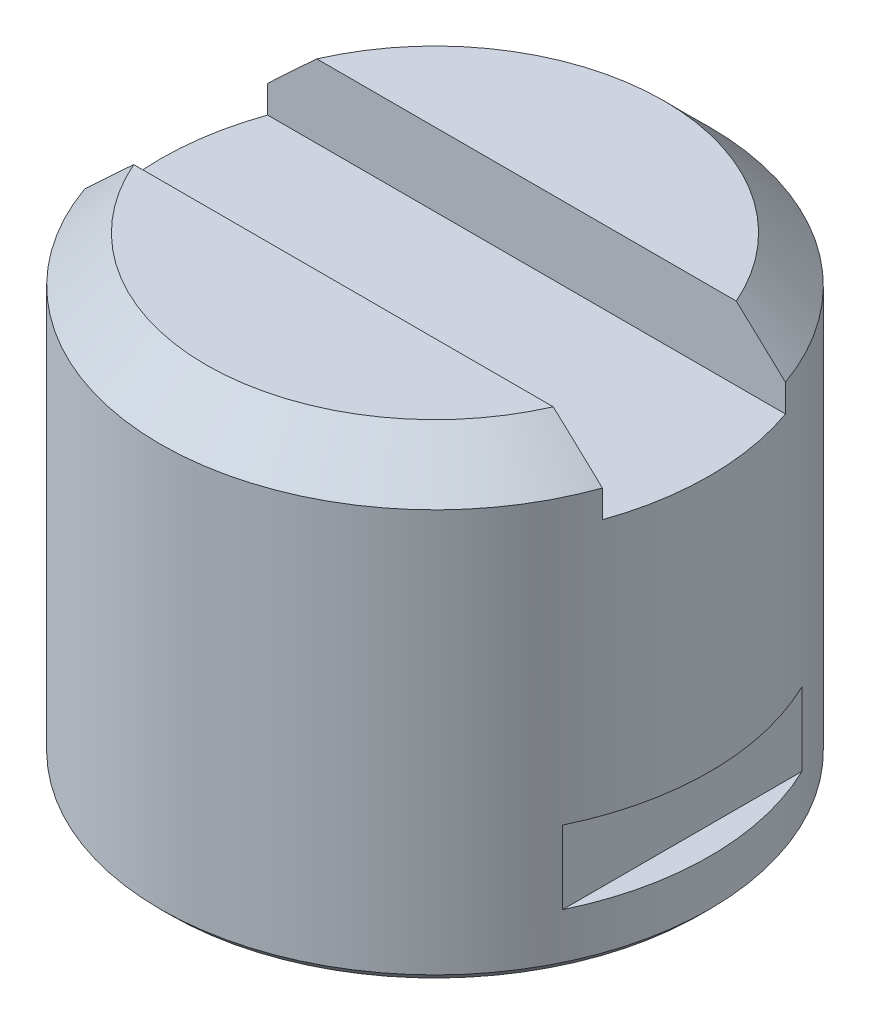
from build123d import *

# Parameters (mm, degrees)
SKETCH1_R               = 30
BOSS_EXTRUDE1_DEPTH     = 50
CUT_EXTRUDE1_DEPTH      = 66.574385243
CUT_EXTRUDE1_DEPTH_BACK = 66.574385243
SKETCH2_W               = 3
SKETCH2_H               = 8
CHAMFER1_SIZE           = 5
CHAMFER2_SIZE           = 1
CUT_EXTRUDE2_DEPTH      = 66.574385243
CUT_EXTRUDE2_DEPTH_BACK = 66.574385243
SKETCH3_W               = 20
SKETCH3_H               = 8


with BuildPart() as part:
    # Sketch1 → Boss-Extrude1 (new body)
    with BuildSketch(Plane(origin=(0, 0, 0), x_dir=(1, 0, 0), z_dir=(0, 1, 0))):
        with Locations(Location((0, 0, 0), (0, 0, 270))):
            Circle(SKETCH1_R)
    extrude(amount=BOSS_EXTRUDE1_DEPTH)

    # Sketch2 → Cut-Extrude1 (cut, two sides: drawn at the far end of the back side and taken through both)
    with BuildSketch(Plane.XY.offset(-CUT_EXTRUDE1_DEPTH_BACK)):
        with Locations((-28.5, 10)):
            Rectangle(SKETCH2_W, SKETCH2_H)
        with Locations((28.5, 10)):
            Rectangle(SKETCH2_W, SKETCH2_H)
    extrude(amount=CUT_EXTRUDE1_DEPTH + CUT_EXTRUDE1_DEPTH_BACK, mode=Mode.SUBTRACT)

    # Chamfer1
    chamfer1_edges = [part.edges().sort_by_distance(p)[0] for p in [
        (0, 50, -30),
    ]]
    chamfer(chamfer1_edges, length=CHAMFER1_SIZE)

    # Chamfer2
    chamfer2_edges = [part.edges().sort_by_distance(p)[0] for p in [
        (0, 0, -30),
    ]]
    chamfer(chamfer2_edges, length=CHAMFER2_SIZE)

    # Sketch3 → Cut-Extrude2 (cut, two sides: drawn at the far end of the back side and taken through both)
    with BuildSketch(Plane(origin=(0, 0, 0), x_dir=(0, 0, -1), z_dir=(1, 0, 0)).offset(-CUT_EXTRUDE2_DEPTH_BACK)):
        with Locations((0, 46)):
            Rectangle(SKETCH3_W, SKETCH3_H)
    extrude(amount=CUT_EXTRUDE2_DEPTH + CUT_EXTRUDE2_DEPTH_BACK, mode=Mode.SUBTRACT)


solid = part.part
